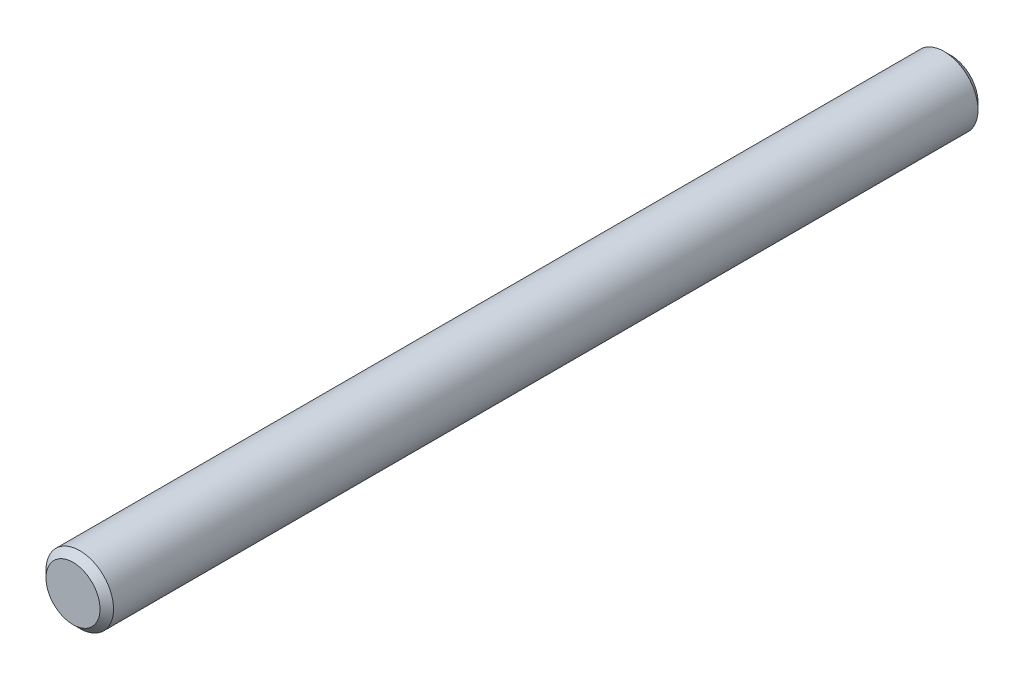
from build123d import *

# Parameters (mm, degrees)
ESQUISSE1_R      = 5
EXTRUSION1_DEPTH = 130
CHANFREIN1_SIZE  = 1


with BuildPart() as part:
    # Esquisse1 → Extrusion1 (new body)
    with BuildSketch(Plane.XY):
        Circle(ESQUISSE1_R)
    extrude(amount=EXTRUSION1_DEPTH)

    # Chanfrein1
    chanfrein1_edges = [part.edges().sort_by_distance(p)[0] for p in [
        (-5, 0, 0),
        (-5, 0, 130),
    ]]
    chamfer(chanfrein1_edges, length=CHANFREIN1_SIZE)


solid = part.part
